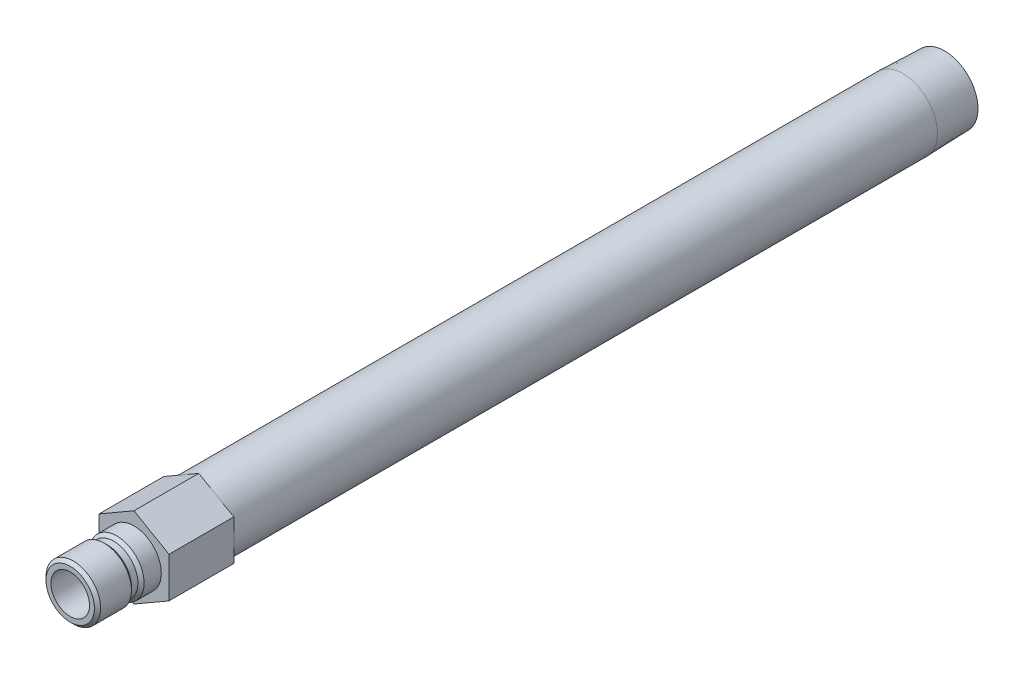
ISO-10303-21;
HEADER;
FILE_DESCRIPTION(('STEP AP214'),'2;1');
FILE_NAME('part.step','',(''),(''),'','','');
FILE_SCHEMA(('AUTOMOTIVE_DESIGN { 1 0 10303 214 1 1 1 1 }'));
ENDSEC;
DATA;
#1=APPLICATION_CONTEXT('core data for automotive mechanical design processes');
#2=APPLICATION_PROTOCOL_DEFINITION('international standard','automotive_design',2000,#1);
#3=PRODUCT_CONTEXT('',#1,'mechanical');
#4=PRODUCT('Part','Part','',(#3));
#5=PRODUCT_RELATED_PRODUCT_CATEGORY('part','',(#4));
#6=PRODUCT_DEFINITION_FORMATION('','',#4);
#7=PRODUCT_DEFINITION_CONTEXT('part definition',#1,'design');
#8=PRODUCT_DEFINITION('design','',#6,#7);
#9=PRODUCT_DEFINITION_SHAPE('','',#8);
#10=(LENGTH_UNIT() NAMED_UNIT(*) SI_UNIT(.MILLI.,.METRE.));
#11=(NAMED_UNIT(*) PLANE_ANGLE_UNIT() SI_UNIT($,.RADIAN.));
#12=(NAMED_UNIT(*) SI_UNIT($,.STERADIAN.) SOLID_ANGLE_UNIT());
#13=UNCERTAINTY_MEASURE_WITH_UNIT(LENGTH_MEASURE(1.E-05),#10,'distance_accuracy_value','');
#14=(GEOMETRIC_REPRESENTATION_CONTEXT(3) GLOBAL_UNCERTAINTY_ASSIGNED_CONTEXT((#13)) GLOBAL_UNIT_ASSIGNED_CONTEXT((#10,
#11,#12)) REPRESENTATION_CONTEXT('',''));
#15=CARTESIAN_POINT('',(0.,0.,0.));
#16=DIRECTION('',(0.,0.,1.));
#17=DIRECTION('',(1.,0.,0.));
#18=AXIS2_PLACEMENT_3D('',#15,#16,#17);
#19=CARTESIAN_POINT('',(0.,0.,0.));
#20=DIRECTION('',(0.,0.,-1.));
#21=DIRECTION('',(0.,1.,0.));
#22=AXIS2_PLACEMENT_3D('',#19,#20,#21);
#23=CYLINDRICAL_SURFACE('',#22,8.57249999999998);
#24=CARTESIAN_POINT('',(0.,0.,-189.8142));
#25=DIRECTION('',(0.,0.,-1.));
#26=DIRECTION('',(0.,1.,0.));
#27=AXIS2_PLACEMENT_3D('',#24,#25,#26);
#28=CIRCLE('',#27,8.57249999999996);
#29=CARTESIAN_POINT('',(0.,8.5725,-189.8142));
#30=VERTEX_POINT('',#29);
#31=EDGE_CURVE('E168',#30,#30,#28,.T.);
#32=ORIENTED_EDGE('',*,*,#31,.F.);
#33=EDGE_LOOP('',(#32));
#34=FACE_BOUND('',#33,.T.);
#35=CARTESIAN_POINT('',(0.,0.,-16.002));
#36=DIRECTION('',(0.,0.,1.));
#37=DIRECTION('',(1.,0.,0.));
#38=AXIS2_PLACEMENT_3D('',#35,#36,#37);
#39=CIRCLE('',#38,8.57249999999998);
#40=CARTESIAN_POINT('',(8.57249999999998,0.,-16.002));
#41=VERTEX_POINT('',#40);
#42=EDGE_CURVE('E37',#41,#41,#39,.F.);
#43=ORIENTED_EDGE('',*,*,#42,.T.);
#44=EDGE_LOOP('',(#43));
#45=FACE_BOUND('',#44,.T.);
#46=ADVANCED_FACE('F33',(#34,#45),#23,.T.);
#47=CARTESIAN_POINT('',(0.,0.,0.));
#48=DIRECTION('',(0.,0.,-1.));
#49=DIRECTION('',(0.,1.,0.));
#50=AXIS2_PLACEMENT_3D('',#47,#48,#49);
#51=CYLINDRICAL_SURFACE('',#50,4.7625);
#52=CARTESIAN_POINT('',(0.,0.,15.748));
#53=DIRECTION('',(0.,0.,-1.));
#54=DIRECTION('',(0.,1.,0.));
#55=AXIS2_PLACEMENT_3D('',#52,#53,#54);
#56=CIRCLE('',#55,4.7625);
#57=CARTESIAN_POINT('',(0.,4.7625,15.748));
#58=VERTEX_POINT('',#57);
#59=EDGE_CURVE('E144',#58,#58,#56,.T.);
#60=ORIENTED_EDGE('',*,*,#59,.F.);
#61=EDGE_LOOP('',(#60));
#62=FACE_BOUND('',#61,.T.);
#63=CARTESIAN_POINT('',(0.,0.,-16.002));
#64=DIRECTION('',(0.,0.,-1.));
#65=DIRECTION('',(0.,1.,0.));
#66=AXIS2_PLACEMENT_3D('',#63,#64,#65);
#67=CIRCLE('',#66,4.76249999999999);
#68=CARTESIAN_POINT('',(0.,4.7625,-16.002));
#69=VERTEX_POINT('',#68);
#70=EDGE_CURVE('E11',#69,#69,#67,.T.);
#71=ORIENTED_EDGE('',*,*,#70,.T.);
#72=EDGE_LOOP('',(#71));
#73=FACE_BOUND('',#72,.T.);
#74=ADVANCED_FACE('F35',(#62,#73),#51,.F.);
#75=CARTESIAN_POINT('',(0.,4.7625,-16.002));
#76=DIRECTION('',(0.,0.,-1.));
#77=DIRECTION('',(0.,1.,0.));
#78=AXIS2_PLACEMENT_3D('',#75,#76,#77);
#79=PLANE('',#78);
#80=CARTESIAN_POINT('',(0.,0.,-16.002));
#81=DIRECTION('',(0.,0.,-1.));
#82=DIRECTION('',(0.,1.,0.));
#83=AXIS2_PLACEMENT_3D('',#80,#81,#82);
#84=CIRCLE('',#83,6.26109999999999);
#85=CARTESIAN_POINT('',(0.,6.2611,-16.002));
#86=VERTEX_POINT('',#85);
#87=EDGE_CURVE('E43',#86,#86,#84,.T.);
#88=ORIENTED_EDGE('',*,*,#87,.T.);
#89=EDGE_LOOP('',(#88));
#90=FACE_BOUND('',#89,.T.);
#91=ORIENTED_EDGE('',*,*,#70,.F.);
#92=EDGE_LOOP('',(#91));
#93=FACE_BOUND('',#92,.T.);
#94=ADVANCED_FACE('F180',(#90,#93),#79,.T.);
#95=CARTESIAN_POINT('',(0.,0.,0.));
#96=DIRECTION('',(0.,0.,-1.));
#97=DIRECTION('',(0.,1.,0.));
#98=AXIS2_PLACEMENT_3D('',#95,#96,#97);
#99=CYLINDRICAL_SURFACE('',#98,6.26109999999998);
#100=CARTESIAN_POINT('',(0.,0.,-200.152));
#101=DIRECTION('',(0.,0.,-1.));
#102=DIRECTION('',(0.,1.,0.));
#103=AXIS2_PLACEMENT_3D('',#100,#101,#102);
#104=CIRCLE('',#103,6.26109999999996);
#105=CARTESIAN_POINT('',(0.,6.2611,-200.152));
#106=VERTEX_POINT('',#105);
#107=EDGE_CURVE('E174',#106,#106,#104,.T.);
#108=ORIENTED_EDGE('',*,*,#107,.T.);
#109=EDGE_LOOP('',(#108));
#110=FACE_BOUND('',#109,.T.);
#111=ORIENTED_EDGE('',*,*,#87,.F.);
#112=EDGE_LOOP('',(#111));
#113=FACE_BOUND('',#112,.T.);
#114=ADVANCED_FACE('F183',(#110,#113),#99,.F.);
#115=CARTESIAN_POINT('',(0.,8.24944566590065,-200.152));
#116=DIRECTION('',(0.,0.,-1.));
#117=DIRECTION('',(0.,1.,0.));
#118=AXIS2_PLACEMENT_3D('',#115,#116,#117);
#119=PLANE('',#118);
#120=CARTESIAN_POINT('',(0.,0.,-200.152));
#121=DIRECTION('',(0.,0.,-1.));
#122=DIRECTION('',(0.,1.,0.));
#123=AXIS2_PLACEMENT_3D('',#120,#121,#122);
#124=CIRCLE('',#123,8.24944566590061);
#125=CARTESIAN_POINT('',(0.,8.24944566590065,-200.152));
#126=VERTEX_POINT('',#125);
#127=EDGE_CURVE('E171',#126,#126,#124,.T.);
#128=ORIENTED_EDGE('',*,*,#127,.T.);
#129=EDGE_LOOP('',(#128));
#130=FACE_BOUND('',#129,.T.);
#131=ORIENTED_EDGE('',*,*,#107,.F.);
#132=EDGE_LOOP('',(#131));
#133=FACE_BOUND('',#132,.T.);
#134=ADVANCED_FACE('F185',(#130,#133),#119,.T.);
#135=CARTESIAN_POINT('',(0.,0.,-200.152));
#136=DIRECTION('',(0.,0.,1.));
#137=DIRECTION('',(0.,-1.,0.));
#138=AXIS2_PLACEMENT_3D('',#135,#136,#137);
#139=CONICAL_SURFACE('',#138,8.24944566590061,0.0312396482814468);
#140=ORIENTED_EDGE('',*,*,#31,.T.);
#141=EDGE_LOOP('',(#140));
#142=FACE_BOUND('',#141,.T.);
#143=ORIENTED_EDGE('',*,*,#127,.F.);
#144=EDGE_LOOP('',(#143));
#145=FACE_BOUND('',#144,.T.);
#146=ADVANCED_FACE('F192',(#142,#145),#139,.T.);
#147=CARTESIAN_POINT('',(0.,6.7437,0.));
#148=DIRECTION('',(0.,0.,1.));
#149=DIRECTION('',(0.,-1.,0.));
#150=AXIS2_PLACEMENT_3D('',#147,#148,#149);
#151=PLANE('',#150);
#152=CARTESIAN_POINT('',(0.,0.,0.));
#153=DIRECTION('',(0.,0.,-1.));
#154=DIRECTION('',(0.,1.,0.));
#155=AXIS2_PLACEMENT_3D('',#152,#153,#154);
#156=CIRCLE('',#155,6.7437);
#157=CARTESIAN_POINT('',(0.,6.7437,0.));
#158=VERTEX_POINT('',#157);
#159=EDGE_CURVE('E165',#158,#158,#156,.T.);
#160=ORIENTED_EDGE('',*,*,#159,.T.);
#161=EDGE_LOOP('',(#160));
#162=FACE_BOUND('',#161,.T.);
#163=DIRECTION('',(-0.866025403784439,-0.5,0.));
#164=VECTOR('',#163,1.);
#165=CARTESIAN_POINT('',(0.,9.97199384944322,0.));
#166=LINE('',#165,#164);
#167=CARTESIAN_POINT('',(0.,9.97199384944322,0.));
#168=VERTEX_POINT('',#167);
#169=CARTESIAN_POINT('',(-8.636,4.98599692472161,0.));
#170=VERTEX_POINT('',#169);
#171=EDGE_CURVE('E122',#168,#170,#166,.T.);
#172=ORIENTED_EDGE('',*,*,#171,.T.);
#173=DIRECTION('',(0.,-1.,0.));
#174=VECTOR('',#173,1.);
#175=CARTESIAN_POINT('',(-8.636,4.98599692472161,0.));
#176=LINE('',#175,#174);
#177=CARTESIAN_POINT('',(-8.636,-4.98599692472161,0.));
#178=VERTEX_POINT('',#177);
#179=EDGE_CURVE('E125',#170,#178,#176,.T.);
#180=ORIENTED_EDGE('',*,*,#179,.T.);
#181=DIRECTION('',(0.866025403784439,-0.5,0.));
#182=VECTOR('',#181,1.);
#183=CARTESIAN_POINT('',(-8.636,-4.98599692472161,0.));
#184=LINE('',#183,#182);
#185=CARTESIAN_POINT('',(0.,-9.97199384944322,0.));
#186=VERTEX_POINT('',#185);
#187=EDGE_CURVE('E128',#178,#186,#184,.T.);
#188=ORIENTED_EDGE('',*,*,#187,.T.);
#189=DIRECTION('',(0.866025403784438,0.5,0.));
#190=VECTOR('',#189,1.);
#191=CARTESIAN_POINT('',(0.,-9.97199384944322,0.));
#192=LINE('',#191,#190);
#193=CARTESIAN_POINT('',(8.63599999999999,-4.98599692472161,0.));
#194=VERTEX_POINT('',#193);
#195=EDGE_CURVE('E131',#186,#194,#192,.T.);
#196=ORIENTED_EDGE('',*,*,#195,.T.);
#197=DIRECTION('',(0.,1.,0.));
#198=VECTOR('',#197,1.);
#199=CARTESIAN_POINT('',(8.63599999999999,-4.98599692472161,0.));
#200=LINE('',#199,#198);
#201=CARTESIAN_POINT('',(8.636,4.98599692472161,0.));
#202=VERTEX_POINT('',#201);
#203=EDGE_CURVE('E99',#194,#202,#200,.T.);
#204=ORIENTED_EDGE('',*,*,#203,.T.);
#205=DIRECTION('',(-0.866025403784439,0.5,0.));
#206=VECTOR('',#205,1.);
#207=CARTESIAN_POINT('',(8.636,4.98599692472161,0.));
#208=LINE('',#207,#206);
#209=EDGE_CURVE('E134',#202,#168,#208,.T.);
#210=ORIENTED_EDGE('',*,*,#209,.T.);
#211=EDGE_LOOP('',(#172,#180,#188,#196,#204,#210));
#212=FACE_BOUND('',#211,.T.);
#213=ADVANCED_FACE('F206',(#162,#212),#151,.T.);
#214=CARTESIAN_POINT('',(0.,0.,0.));
#215=DIRECTION('',(0.,0.,-1.));
#216=DIRECTION('',(0.,1.,0.));
#217=AXIS2_PLACEMENT_3D('',#214,#215,#216);
#218=CYLINDRICAL_SURFACE('',#217,6.7437);
#219=CARTESIAN_POINT('',(0.,0.,4.25449999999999));
#220=DIRECTION('',(0.,0.,-1.));
#221=DIRECTION('',(0.,1.,0.));
#222=AXIS2_PLACEMENT_3D('',#219,#220,#221);
#223=CIRCLE('',#222,6.7437);
#224=CARTESIAN_POINT('',(0.,6.7437,4.2545));
#225=VERTEX_POINT('',#224);
#226=EDGE_CURVE('E162',#225,#225,#223,.T.);
#227=ORIENTED_EDGE('',*,*,#226,.T.);
#228=EDGE_LOOP('',(#227));
#229=FACE_BOUND('',#228,.T.);
#230=ORIENTED_EDGE('',*,*,#159,.F.);
#231=EDGE_LOOP('',(#230));
#232=FACE_BOUND('',#231,.T.);
#233=ADVANCED_FACE('F213',(#229,#232),#218,.T.);
#234=CARTESIAN_POINT('',(0.,0.,4.25449999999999));
#235=DIRECTION('',(0.,0.,-1.));
#236=DIRECTION('',(0.,1.,0.));
#237=AXIS2_PLACEMENT_3D('',#234,#235,#236);
#238=CONICAL_SURFACE('',#237,6.7437,0.785398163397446);
#239=CARTESIAN_POINT('',(0.,0.,5.0165));
#240=DIRECTION('',(0.,0.,-1.));
#241=DIRECTION('',(0.,1.,0.));
#242=AXIS2_PLACEMENT_3D('',#239,#240,#241);
#243=CIRCLE('',#242,5.9817);
#244=CARTESIAN_POINT('',(0.,5.9817,5.0165));
#245=VERTEX_POINT('',#244);
#246=EDGE_CURVE('E159',#245,#245,#243,.T.);
#247=ORIENTED_EDGE('',*,*,#246,.T.);
#248=EDGE_LOOP('',(#247));
#249=FACE_BOUND('',#248,.T.);
#250=ORIENTED_EDGE('',*,*,#226,.F.);
#251=EDGE_LOOP('',(#250));
#252=FACE_BOUND('',#251,.T.);
#253=ADVANCED_FACE('F222',(#249,#252),#238,.T.);
#254=CARTESIAN_POINT('',(0.,0.,0.));
#255=DIRECTION('',(0.,0.,-1.));
#256=DIRECTION('',(0.,1.,0.));
#257=AXIS2_PLACEMENT_3D('',#254,#255,#256);
#258=CYLINDRICAL_SURFACE('',#257,5.9817);
#259=CARTESIAN_POINT('',(0.,0.,6.604));
#260=DIRECTION('',(0.,0.,-1.));
#261=DIRECTION('',(0.,1.,0.));
#262=AXIS2_PLACEMENT_3D('',#259,#260,#261);
#263=CIRCLE('',#262,5.9817);
#264=CARTESIAN_POINT('',(0.,5.9817,6.604));
#265=VERTEX_POINT('',#264);
#266=EDGE_CURVE('E156',#265,#265,#263,.T.);
#267=ORIENTED_EDGE('',*,*,#266,.T.);
#268=EDGE_LOOP('',(#267));
#269=FACE_BOUND('',#268,.T.);
#270=ORIENTED_EDGE('',*,*,#246,.F.);
#271=EDGE_LOOP('',(#270));
#272=FACE_BOUND('',#271,.T.);
#273=ADVANCED_FACE('F263',(#269,#272),#258,.T.);
#274=CARTESIAN_POINT('',(0.,0.,6.604));
#275=DIRECTION('',(0.,0.,1.));
#276=DIRECTION('',(0.,-1.,0.));
#277=AXIS2_PLACEMENT_3D('',#274,#275,#276);
#278=CONICAL_SURFACE('',#277,5.9817,0.785398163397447);
#279=CARTESIAN_POINT('',(0.,0.,7.366));
#280=DIRECTION('',(0.,0.,-1.));
#281=DIRECTION('',(0.,1.,0.));
#282=AXIS2_PLACEMENT_3D('',#279,#280,#281);
#283=CIRCLE('',#282,6.7437);
#284=CARTESIAN_POINT('',(0.,6.7437,7.366));
#285=VERTEX_POINT('',#284);
#286=EDGE_CURVE('E153',#285,#285,#283,.T.);
#287=ORIENTED_EDGE('',*,*,#286,.T.);
#288=EDGE_LOOP('',(#287));
#289=FACE_BOUND('',#288,.T.);
#290=ORIENTED_EDGE('',*,*,#266,.F.);
#291=EDGE_LOOP('',(#290));
#292=FACE_BOUND('',#291,.T.);
#293=ADVANCED_FACE('F259',(#289,#292),#278,.T.);
#294=CARTESIAN_POINT('',(0.,0.,0.));
#295=DIRECTION('',(0.,0.,-1.));
#296=DIRECTION('',(0.,1.,0.));
#297=AXIS2_PLACEMENT_3D('',#294,#295,#296);
#298=CYLINDRICAL_SURFACE('',#297,6.7437);
#299=CARTESIAN_POINT('',(0.,0.,14.986));
#300=DIRECTION('',(0.,0.,-1.));
#301=DIRECTION('',(0.,1.,0.));
#302=AXIS2_PLACEMENT_3D('',#299,#300,#301);
#303=CIRCLE('',#302,6.7437);
#304=CARTESIAN_POINT('',(0.,6.7437,14.986));
#305=VERTEX_POINT('',#304);
#306=EDGE_CURVE('E150',#305,#305,#303,.T.);
#307=ORIENTED_EDGE('',*,*,#306,.T.);
#308=EDGE_LOOP('',(#307));
#309=FACE_BOUND('',#308,.T.);
#310=ORIENTED_EDGE('',*,*,#286,.F.);
#311=EDGE_LOOP('',(#310));
#312=FACE_BOUND('',#311,.T.);
#313=ADVANCED_FACE('F255',(#309,#312),#298,.T.);
#314=CARTESIAN_POINT('',(0.,0.,14.986));
#315=DIRECTION('',(0.,0.,-1.));
#316=DIRECTION('',(0.,1.,0.));
#317=AXIS2_PLACEMENT_3D('',#314,#315,#316);
#318=CONICAL_SURFACE('',#317,6.7437,0.785398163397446);
#319=CARTESIAN_POINT('',(0.,0.,15.748));
#320=DIRECTION('',(0.,0.,-1.));
#321=DIRECTION('',(0.,1.,0.));
#322=AXIS2_PLACEMENT_3D('',#319,#320,#321);
#323=CIRCLE('',#322,5.9817);
#324=CARTESIAN_POINT('',(0.,5.9817,15.748));
#325=VERTEX_POINT('',#324);
#326=EDGE_CURVE('E147',#325,#325,#323,.T.);
#327=ORIENTED_EDGE('',*,*,#326,.T.);
#328=EDGE_LOOP('',(#327));
#329=FACE_BOUND('',#328,.T.);
#330=ORIENTED_EDGE('',*,*,#306,.F.);
#331=EDGE_LOOP('',(#330));
#332=FACE_BOUND('',#331,.T.);
#333=ADVANCED_FACE('F251',(#329,#332),#318,.T.);
#334=CARTESIAN_POINT('',(0.,4.7625,15.748));
#335=DIRECTION('',(0.,0.,1.));
#336=DIRECTION('',(0.,-1.,0.));
#337=AXIS2_PLACEMENT_3D('',#334,#335,#336);
#338=PLANE('',#337);
#339=ORIENTED_EDGE('',*,*,#59,.T.);
#340=EDGE_LOOP('',(#339));
#341=FACE_BOUND('',#340,.T.);
#342=ORIENTED_EDGE('',*,*,#326,.F.);
#343=EDGE_LOOP('',(#342));
#344=FACE_BOUND('',#343,.T.);
#345=ADVANCED_FACE('F239',(#341,#344),#338,.T.);
#346=CARTESIAN_POINT('',(0.,9.97199384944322,-16.002));
#347=DIRECTION('',(-0.5,0.866025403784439,0.));
#348=DIRECTION('',(-0.866025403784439,-0.5,0.));
#349=AXIS2_PLACEMENT_3D('',#346,#347,#348);
#350=PLANE('',#349);
#351=ORIENTED_EDGE('',*,*,#171,.F.);
#352=DIRECTION('',(0.,0.,1.));
#353=VECTOR('',#352,1.);
#354=CARTESIAN_POINT('',(0.,9.97199384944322,-16.002));
#355=LINE('',#354,#353);
#356=CARTESIAN_POINT('',(0.,9.97199384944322,-16.002));
#357=VERTEX_POINT('',#356);
#358=EDGE_CURVE('E51',#357,#168,#355,.T.);
#359=ORIENTED_EDGE('',*,*,#358,.F.);
#360=DIRECTION('',(-0.866025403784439,-0.5,0.));
#361=VECTOR('',#360,1.);
#362=CARTESIAN_POINT('',(0.,9.97199384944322,-16.002));
#363=LINE('',#362,#361);
#364=CARTESIAN_POINT('',(-8.636,4.98599692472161,-16.002));
#365=VERTEX_POINT('',#364);
#366=EDGE_CURVE('E137',#357,#365,#363,.T.);
#367=ORIENTED_EDGE('',*,*,#366,.T.);
#368=DIRECTION('',(0.,0.,1.));
#369=VECTOR('',#368,1.);
#370=CARTESIAN_POINT('',(-8.636,4.98599692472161,-16.002));
#371=LINE('',#370,#369);
#372=EDGE_CURVE('E86',#365,#170,#371,.T.);
#373=ORIENTED_EDGE('',*,*,#372,.T.);
#374=EDGE_LOOP('',(#351,#359,#367,#373));
#375=FACE_BOUND('',#374,.T.);
#376=ADVANCED_FACE('F226',(#375),#350,.T.);
#377=CARTESIAN_POINT('',(8.636,4.98599692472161,-16.002));
#378=DIRECTION('',(0.5,0.866025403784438,0.));
#379=DIRECTION('',(-0.866025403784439,0.5,0.));
#380=AXIS2_PLACEMENT_3D('',#377,#378,#379);
#381=PLANE('',#380);
#382=ORIENTED_EDGE('',*,*,#209,.F.);
#383=DIRECTION('',(0.,0.,1.));
#384=VECTOR('',#383,1.);
#385=CARTESIAN_POINT('',(8.636,4.98599692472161,-16.002));
#386=LINE('',#385,#384);
#387=CARTESIAN_POINT('',(8.636,4.98599692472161,-16.002));
#388=VERTEX_POINT('',#387);
#389=EDGE_CURVE('E74',#388,#202,#386,.T.);
#390=ORIENTED_EDGE('',*,*,#389,.F.);
#391=DIRECTION('',(-0.866025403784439,0.5,0.));
#392=VECTOR('',#391,1.);
#393=CARTESIAN_POINT('',(8.636,4.98599692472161,-16.002));
#394=LINE('',#393,#392);
#395=EDGE_CURVE('E112',#388,#357,#394,.T.);
#396=ORIENTED_EDGE('',*,*,#395,.T.);
#397=ORIENTED_EDGE('',*,*,#358,.T.);
#398=EDGE_LOOP('',(#382,#390,#396,#397));
#399=FACE_BOUND('',#398,.T.);
#400=ADVANCED_FACE('F231',(#399),#381,.T.);
#401=CARTESIAN_POINT('',(8.63599999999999,-4.98599692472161,-16.002));
#402=DIRECTION('',(1.,0.,0.));
#403=DIRECTION('',(0.,1.,0.));
#404=AXIS2_PLACEMENT_3D('',#401,#402,#403);
#405=PLANE('',#404);
#406=ORIENTED_EDGE('',*,*,#203,.F.);
#407=DIRECTION('',(0.,0.,1.));
#408=VECTOR('',#407,1.);
#409=CARTESIAN_POINT('',(8.63599999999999,-4.98599692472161,-16.002));
#410=LINE('',#409,#408);
#411=CARTESIAN_POINT('',(8.63599999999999,-4.98599692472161,-16.002));
#412=VERTEX_POINT('',#411);
#413=EDGE_CURVE('E94',#412,#194,#410,.T.);
#414=ORIENTED_EDGE('',*,*,#413,.F.);
#415=DIRECTION('',(0.,1.,0.));
#416=VECTOR('',#415,1.);
#417=CARTESIAN_POINT('',(8.63599999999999,-4.98599692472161,-16.002));
#418=LINE('',#417,#416);
#419=EDGE_CURVE('E97',#412,#388,#418,.T.);
#420=ORIENTED_EDGE('',*,*,#419,.T.);
#421=ORIENTED_EDGE('',*,*,#389,.T.);
#422=EDGE_LOOP('',(#406,#414,#420,#421));
#423=FACE_BOUND('',#422,.T.);
#424=ADVANCED_FACE('F96',(#423),#405,.T.);
#425=CARTESIAN_POINT('',(0.,-9.97199384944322,-16.002));
#426=DIRECTION('',(0.5,-0.866025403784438,0.));
#427=DIRECTION('',(0.866025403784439,0.5,0.));
#428=AXIS2_PLACEMENT_3D('',#425,#426,#427);
#429=PLANE('',#428);
#430=ORIENTED_EDGE('',*,*,#195,.F.);
#431=DIRECTION('',(0.,0.,1.));
#432=VECTOR('',#431,1.);
#433=CARTESIAN_POINT('',(0.,-9.97199384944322,-16.002));
#434=LINE('',#433,#432);
#435=CARTESIAN_POINT('',(0.,-9.97199384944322,-16.002));
#436=VERTEX_POINT('',#435);
#437=EDGE_CURVE('E104',#436,#186,#434,.T.);
#438=ORIENTED_EDGE('',*,*,#437,.F.);
#439=DIRECTION('',(0.866025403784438,0.5,0.));
#440=VECTOR('',#439,1.);
#441=CARTESIAN_POINT('',(0.,-9.97199384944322,-16.002));
#442=LINE('',#441,#440);
#443=EDGE_CURVE('E110',#436,#412,#442,.T.);
#444=ORIENTED_EDGE('',*,*,#443,.T.);
#445=ORIENTED_EDGE('',*,*,#413,.T.);
#446=EDGE_LOOP('',(#430,#438,#444,#445));
#447=FACE_BOUND('',#446,.T.);
#448=ADVANCED_FACE('F114',(#447),#429,.T.);
#449=CARTESIAN_POINT('',(-8.636,-4.98599692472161,-16.002));
#450=DIRECTION('',(-0.5,-0.866025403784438,0.));
#451=DIRECTION('',(0.866025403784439,-0.5,0.));
#452=AXIS2_PLACEMENT_3D('',#449,#450,#451);
#453=PLANE('',#452);
#454=ORIENTED_EDGE('',*,*,#187,.F.);
#455=DIRECTION('',(0.,0.,1.));
#456=VECTOR('',#455,1.);
#457=CARTESIAN_POINT('',(-8.636,-4.98599692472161,-16.002));
#458=LINE('',#457,#456);
#459=CARTESIAN_POINT('',(-8.636,-4.98599692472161,-16.002));
#460=VERTEX_POINT('',#459);
#461=EDGE_CURVE('E141',#460,#178,#458,.T.);
#462=ORIENTED_EDGE('',*,*,#461,.F.);
#463=DIRECTION('',(0.866025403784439,-0.5,0.));
#464=VECTOR('',#463,1.);
#465=CARTESIAN_POINT('',(-8.636,-4.98599692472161,-16.002));
#466=LINE('',#465,#464);
#467=EDGE_CURVE('E115',#460,#436,#466,.T.);
#468=ORIENTED_EDGE('',*,*,#467,.T.);
#469=ORIENTED_EDGE('',*,*,#437,.T.);
#470=EDGE_LOOP('',(#454,#462,#468,#469));
#471=FACE_BOUND('',#470,.T.);
#472=ADVANCED_FACE('F230',(#471),#453,.T.);
#473=CARTESIAN_POINT('',(-8.636,4.98599692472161,-16.002));
#474=DIRECTION('',(-1.,0.,0.));
#475=DIRECTION('',(0.,0.,1.));
#476=AXIS2_PLACEMENT_3D('',#473,#474,#475);
#477=PLANE('',#476);
#478=ORIENTED_EDGE('',*,*,#179,.F.);
#479=ORIENTED_EDGE('',*,*,#372,.F.);
#480=DIRECTION('',(0.,-1.,0.));
#481=VECTOR('',#480,1.);
#482=CARTESIAN_POINT('',(-8.636,4.98599692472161,-16.002));
#483=LINE('',#482,#481);
#484=EDGE_CURVE('E117',#365,#460,#483,.T.);
#485=ORIENTED_EDGE('',*,*,#484,.T.);
#486=ORIENTED_EDGE('',*,*,#461,.T.);
#487=EDGE_LOOP('',(#478,#479,#485,#486));
#488=FACE_BOUND('',#487,.T.);
#489=ADVANCED_FACE('F227',(#488),#477,.T.);
#490=CARTESIAN_POINT('',(-8.636,4.98599692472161,-16.002));
#491=DIRECTION('',(0.,0.,1.));
#492=DIRECTION('',(1.,0.,0.));
#493=AXIS2_PLACEMENT_3D('',#490,#491,#492);
#494=PLANE('',#493);
#495=ORIENTED_EDGE('',*,*,#42,.F.);
#496=EDGE_LOOP('',(#495));
#497=FACE_BOUND('',#496,.T.);
#498=ORIENTED_EDGE('',*,*,#366,.F.);
#499=ORIENTED_EDGE('',*,*,#395,.F.);
#500=ORIENTED_EDGE('',*,*,#419,.F.);
#501=ORIENTED_EDGE('',*,*,#443,.F.);
#502=ORIENTED_EDGE('',*,*,#467,.F.);
#503=ORIENTED_EDGE('',*,*,#484,.F.);
#504=EDGE_LOOP('',(#498,#499,#500,#501,#502,#503));
#505=FACE_BOUND('',#504,.T.);
#506=ADVANCED_FACE('F108',(#497,#505),#494,.F.);
#507=CLOSED_SHELL('',(#46,#74,#94,#114,#134,#146,#213,#233,#253,#273,#293,#313,#333,#345,#376,
#400,#424,#448,#472,#489,#506));
#508=MANIFOLD_SOLID_BREP('B2',#507);
#509=ADVANCED_BREP_SHAPE_REPRESENTATION('',(#18,#508),#14);
#510=SHAPE_DEFINITION_REPRESENTATION(#9,#509);
ENDSEC;
END-ISO-10303-21;
